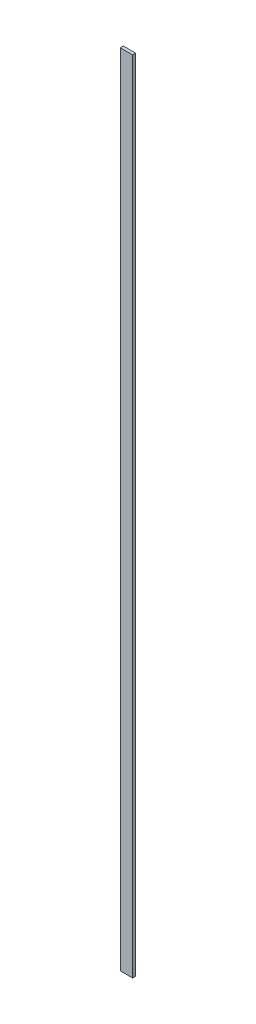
ISO-10303-21;
HEADER;
FILE_DESCRIPTION(('STEP AP214'),'2;1');
FILE_NAME('part.step','',(''),(''),'','','');
FILE_SCHEMA(('AUTOMOTIVE_DESIGN { 1 0 10303 214 1 1 1 1 }'));
ENDSEC;
DATA;
#1=APPLICATION_CONTEXT('core data for automotive mechanical design processes');
#2=APPLICATION_PROTOCOL_DEFINITION('international standard','automotive_design',2000,#1);
#3=PRODUCT_CONTEXT('',#1,'mechanical');
#4=PRODUCT('Part','Part','',(#3));
#5=PRODUCT_RELATED_PRODUCT_CATEGORY('part','',(#4));
#6=PRODUCT_DEFINITION_FORMATION('','',#4);
#7=PRODUCT_DEFINITION_CONTEXT('part definition',#1,'design');
#8=PRODUCT_DEFINITION('design','',#6,#7);
#9=PRODUCT_DEFINITION_SHAPE('','',#8);
#10=(LENGTH_UNIT() NAMED_UNIT(*) SI_UNIT(.MILLI.,.METRE.));
#11=(NAMED_UNIT(*) PLANE_ANGLE_UNIT() SI_UNIT($,.RADIAN.));
#12=(NAMED_UNIT(*) SI_UNIT($,.STERADIAN.) SOLID_ANGLE_UNIT());
#13=UNCERTAINTY_MEASURE_WITH_UNIT(LENGTH_MEASURE(1.E-05),#10,'distance_accuracy_value','');
#14=(GEOMETRIC_REPRESENTATION_CONTEXT(3) GLOBAL_UNCERTAINTY_ASSIGNED_CONTEXT((#13)) GLOBAL_UNIT_ASSIGNED_CONTEXT((#10,
#11,#12)) REPRESENTATION_CONTEXT('',''));
#15=CARTESIAN_POINT('',(0.,0.,0.));
#16=DIRECTION('',(0.,0.,1.));
#17=DIRECTION('',(1.,0.,0.));
#18=AXIS2_PLACEMENT_3D('',#15,#16,#17);
#19=CARTESIAN_POINT('',(-10.,650.,5.));
#20=DIRECTION('',(1.,0.,0.));
#21=DIRECTION('',(0.,1.,0.));
#22=AXIS2_PLACEMENT_3D('',#19,#20,#21);
#23=PLANE('',#22);
#24=DIRECTION('',(0.,-1.,0.));
#25=VECTOR('',#24,1.);
#26=CARTESIAN_POINT('',(-10.,650.,0.));
#27=LINE('',#26,#25);
#28=CARTESIAN_POINT('',(-10.,650.,0.));
#29=VERTEX_POINT('',#28);
#30=CARTESIAN_POINT('',(-9.99999999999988,-650.,0.));
#31=VERTEX_POINT('',#30);
#32=EDGE_CURVE('E99',#29,#31,#27,.T.);
#33=ORIENTED_EDGE('',*,*,#32,.T.);
#34=DIRECTION('',(0.,0.,-1.));
#35=VECTOR('',#34,1.);
#36=CARTESIAN_POINT('',(-9.99999999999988,-650.,5.));
#37=LINE('',#36,#35);
#38=CARTESIAN_POINT('',(-9.99999999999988,-650.,5.));
#39=VERTEX_POINT('',#38);
#40=EDGE_CURVE('E11',#39,#31,#37,.T.);
#41=ORIENTED_EDGE('',*,*,#40,.F.);
#42=DIRECTION('',(0.,-1.,0.));
#43=VECTOR('',#42,1.);
#44=CARTESIAN_POINT('',(-10.,650.,5.));
#45=LINE('',#44,#43);
#46=CARTESIAN_POINT('',(-10.,650.,5.));
#47=VERTEX_POINT('',#46);
#48=EDGE_CURVE('E87',#47,#39,#45,.T.);
#49=ORIENTED_EDGE('',*,*,#48,.F.);
#50=DIRECTION('',(0.,0.,-1.));
#51=VECTOR('',#50,1.);
#52=CARTESIAN_POINT('',(-10.,650.,5.));
#53=LINE('',#52,#51);
#54=EDGE_CURVE('E95',#47,#29,#53,.T.);
#55=ORIENTED_EDGE('',*,*,#54,.T.);
#56=EDGE_LOOP('',(#33,#41,#49,#55));
#57=FACE_BOUND('',#56,.T.);
#58=ADVANCED_FACE('F36',(#57),#23,.F.);
#59=CARTESIAN_POINT('',(-9.99999999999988,-650.,5.));
#60=DIRECTION('',(0.,1.,0.));
#61=DIRECTION('',(0.,0.,1.));
#62=AXIS2_PLACEMENT_3D('',#59,#60,#61);
#63=PLANE('',#62);
#64=DIRECTION('',(1.,0.,0.));
#65=VECTOR('',#64,1.);
#66=CARTESIAN_POINT('',(-9.99999999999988,-650.,0.));
#67=LINE('',#66,#65);
#68=CARTESIAN_POINT('',(10.0000000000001,-650.,0.));
#69=VERTEX_POINT('',#68);
#70=EDGE_CURVE('E91',#31,#69,#67,.T.);
#71=ORIENTED_EDGE('',*,*,#70,.T.);
#72=DIRECTION('',(0.,0.,-1.));
#73=VECTOR('',#72,1.);
#74=CARTESIAN_POINT('',(10.0000000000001,-650.,5.));
#75=LINE('',#74,#73);
#76=CARTESIAN_POINT('',(10.0000000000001,-650.,5.));
#77=VERTEX_POINT('',#76);
#78=EDGE_CURVE('E44',#77,#69,#75,.T.);
#79=ORIENTED_EDGE('',*,*,#78,.F.);
#80=DIRECTION('',(1.,0.,0.));
#81=VECTOR('',#80,1.);
#82=CARTESIAN_POINT('',(-9.99999999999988,-650.,5.));
#83=LINE('',#82,#81);
#84=EDGE_CURVE('E82',#39,#77,#83,.T.);
#85=ORIENTED_EDGE('',*,*,#84,.F.);
#86=ORIENTED_EDGE('',*,*,#40,.T.);
#87=EDGE_LOOP('',(#71,#79,#85,#86));
#88=FACE_BOUND('',#87,.T.);
#89=ADVANCED_FACE('F90',(#88),#63,.F.);
#90=CARTESIAN_POINT('',(9.99999999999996,650.,5.));
#91=DIRECTION('',(-1.,0.,0.));
#92=DIRECTION('',(0.,-1.,0.));
#93=AXIS2_PLACEMENT_3D('',#90,#91,#92);
#94=PLANE('',#93);
#95=DIRECTION('',(0.,1.,0.));
#96=VECTOR('',#95,1.);
#97=CARTESIAN_POINT('',(9.99999999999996,650.,0.));
#98=LINE('',#97,#96);
#99=CARTESIAN_POINT('',(9.99999999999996,650.,0.));
#100=VERTEX_POINT('',#99);
#101=EDGE_CURVE('E69',#69,#100,#98,.T.);
#102=ORIENTED_EDGE('',*,*,#101,.T.);
#103=DIRECTION('',(0.,0.,-1.));
#104=VECTOR('',#103,1.);
#105=CARTESIAN_POINT('',(9.99999999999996,650.,5.));
#106=LINE('',#105,#104);
#107=CARTESIAN_POINT('',(9.99999999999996,650.,5.));
#108=VERTEX_POINT('',#107);
#109=EDGE_CURVE('E92',#108,#100,#106,.T.);
#110=ORIENTED_EDGE('',*,*,#109,.F.);
#111=DIRECTION('',(0.,1.,0.));
#112=VECTOR('',#111,1.);
#113=CARTESIAN_POINT('',(9.99999999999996,650.,5.));
#114=LINE('',#113,#112);
#115=EDGE_CURVE('E85',#77,#108,#114,.T.);
#116=ORIENTED_EDGE('',*,*,#115,.F.);
#117=ORIENTED_EDGE('',*,*,#78,.T.);
#118=EDGE_LOOP('',(#102,#110,#116,#117));
#119=FACE_BOUND('',#118,.T.);
#120=ADVANCED_FACE('F93',(#119),#94,.F.);
#121=CARTESIAN_POINT('',(-10.,650.,5.));
#122=DIRECTION('',(0.,-1.,0.));
#123=DIRECTION('',(0.,0.,-1.));
#124=AXIS2_PLACEMENT_3D('',#121,#122,#123);
#125=PLANE('',#124);
#126=DIRECTION('',(-1.,0.,0.));
#127=VECTOR('',#126,1.);
#128=CARTESIAN_POINT('',(-10.,650.,0.));
#129=LINE('',#128,#127);
#130=EDGE_CURVE('E75',#100,#29,#129,.T.);
#131=ORIENTED_EDGE('',*,*,#130,.T.);
#132=ORIENTED_EDGE('',*,*,#54,.F.);
#133=DIRECTION('',(-1.,0.,0.));
#134=VECTOR('',#133,1.);
#135=CARTESIAN_POINT('',(-10.,650.,5.));
#136=LINE('',#135,#134);
#137=EDGE_CURVE('E52',#108,#47,#136,.T.);
#138=ORIENTED_EDGE('',*,*,#137,.F.);
#139=ORIENTED_EDGE('',*,*,#109,.T.);
#140=EDGE_LOOP('',(#131,#132,#138,#139));
#141=FACE_BOUND('',#140,.T.);
#142=ADVANCED_FACE('F106',(#141),#125,.F.);
#143=CARTESIAN_POINT('',(-9.99999999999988,-650.,5.));
#144=DIRECTION('',(0.,0.,1.));
#145=DIRECTION('',(1.,0.,0.));
#146=AXIS2_PLACEMENT_3D('',#143,#144,#145);
#147=PLANE('',#146);
#148=ORIENTED_EDGE('',*,*,#48,.T.);
#149=ORIENTED_EDGE('',*,*,#84,.T.);
#150=ORIENTED_EDGE('',*,*,#115,.T.);
#151=ORIENTED_EDGE('',*,*,#137,.T.);
#152=EDGE_LOOP('',(#148,#149,#150,#151));
#153=FACE_BOUND('',#152,.T.);
#154=ADVANCED_FACE('F83',(#153),#147,.T.);
#155=CARTESIAN_POINT('',(-9.99999999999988,-650.,0.));
#156=DIRECTION('',(0.,0.,1.));
#157=DIRECTION('',(1.,0.,0.));
#158=AXIS2_PLACEMENT_3D('',#155,#156,#157);
#159=PLANE('',#158);
#160=ORIENTED_EDGE('',*,*,#32,.F.);
#161=ORIENTED_EDGE('',*,*,#130,.F.);
#162=ORIENTED_EDGE('',*,*,#101,.F.);
#163=ORIENTED_EDGE('',*,*,#70,.F.);
#164=EDGE_LOOP('',(#160,#161,#162,#163));
#165=FACE_BOUND('',#164,.T.);
#166=ADVANCED_FACE('F109',(#165),#159,.F.);
#167=CLOSED_SHELL('',(#58,#89,#120,#142,#154,#166));
#168=MANIFOLD_SOLID_BREP('B2',#167);
#169=ADVANCED_BREP_SHAPE_REPRESENTATION('',(#18,#168),#14);
#170=SHAPE_DEFINITION_REPRESENTATION(#9,#169);
ENDSEC;
END-ISO-10303-21;
